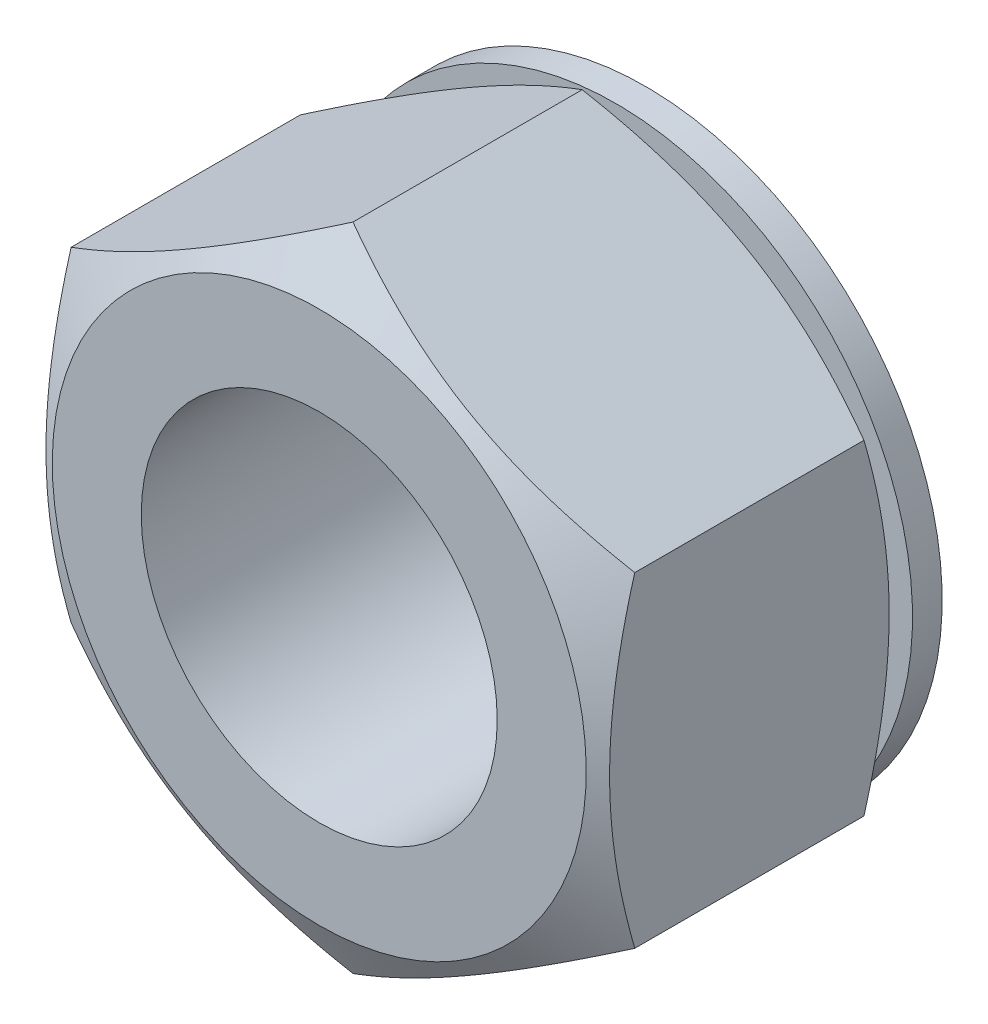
ISO-10303-21;
HEADER;
FILE_DESCRIPTION(('STEP AP214'),'2;1');
FILE_NAME('part.step','',(''),(''),'','','');
FILE_SCHEMA(('AUTOMOTIVE_DESIGN { 1 0 10303 214 1 1 1 1 }'));
ENDSEC;
DATA;
#1=APPLICATION_CONTEXT('core data for automotive mechanical design processes');
#2=APPLICATION_PROTOCOL_DEFINITION('international standard','automotive_design',2000,#1);
#3=PRODUCT_CONTEXT('',#1,'mechanical');
#4=PRODUCT('Part','Part','',(#3));
#5=PRODUCT_RELATED_PRODUCT_CATEGORY('part','',(#4));
#6=PRODUCT_DEFINITION_FORMATION('','',#4);
#7=PRODUCT_DEFINITION_CONTEXT('part definition',#1,'design');
#8=PRODUCT_DEFINITION('design','',#6,#7);
#9=PRODUCT_DEFINITION_SHAPE('','',#8);
#10=(LENGTH_UNIT() NAMED_UNIT(*) SI_UNIT(.MILLI.,.METRE.));
#11=(NAMED_UNIT(*) PLANE_ANGLE_UNIT() SI_UNIT($,.RADIAN.));
#12=(NAMED_UNIT(*) SI_UNIT($,.STERADIAN.) SOLID_ANGLE_UNIT());
#13=UNCERTAINTY_MEASURE_WITH_UNIT(LENGTH_MEASURE(1.E-05),#10,'distance_accuracy_value','');
#14=(GEOMETRIC_REPRESENTATION_CONTEXT(3) GLOBAL_UNCERTAINTY_ASSIGNED_CONTEXT((#13)) GLOBAL_UNIT_ASSIGNED_CONTEXT((#10,
#11,#12)) REPRESENTATION_CONTEXT('',''));
#15=CARTESIAN_POINT('',(0.,0.,0.));
#16=DIRECTION('',(0.,0.,1.));
#17=DIRECTION('',(1.,0.,0.));
#18=AXIS2_PLACEMENT_3D('',#15,#16,#17);
#19=CARTESIAN_POINT('',(9.5,-5.48482755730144,1.));
#20=DIRECTION('',(1.,0.,0.));
#21=DIRECTION('',(0.,0.,-1.));
#22=AXIS2_PLACEMENT_3D('',#19,#20,#21);
#23=PLANE('',#22);
#24=DIRECTION('',(0.,0.,1.));
#25=VECTOR('',#24,1.);
#26=CARTESIAN_POINT('',(9.5,-5.48482755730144,1.));
#27=LINE('',#26,#25);
#28=CARTESIAN_POINT('',(9.5,-5.48482755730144,2.13718091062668));
#29=VERTEX_POINT('',#28);
#30=CARTESIAN_POINT('',(9.5,-5.48482755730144,9.86281908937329));
#31=VERTEX_POINT('',#30);
#32=EDGE_CURVE('E23',#29,#31,#27,.T.);
#33=ORIENTED_EDGE('',*,*,#32,.F.);
#34=CARTESIAN_POINT('',(9.5,-14.6203705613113,5.87038017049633));
#35=CARTESIAN_POINT('',(9.5,-14.4133760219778,5.77017103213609));
#36=CARTESIAN_POINT('',(9.5,-14.2061355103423,5.67047021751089));
#37=CARTESIAN_POINT('',(9.5,-13.7911111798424,5.47220059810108));
#38=CARTESIAN_POINT('',(9.5,-13.5833273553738,5.37363180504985));
#39=CARTESIAN_POINT('',(9.5,-12.9590269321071,5.07976977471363));
#40=CARTESIAN_POINT('',(9.5,-12.5416243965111,4.88635147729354));
#41=CARTESIAN_POINT('',(9.5,-11.7016619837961,4.50464044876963));
#42=CARTESIAN_POINT('',(9.5,-11.279086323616,4.31638236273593));
#43=CARTESIAN_POINT('',(9.5,-10.4305349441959,3.94771952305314));
#44=CARTESIAN_POINT('',(9.5,-10.004559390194,3.76731439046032));
#45=CARTESIAN_POINT('',(9.5,-9.13523598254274,3.41099063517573));
#46=CARTESIAN_POINT('',(9.5,-8.69175917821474,3.2353848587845));
#47=CARTESIAN_POINT('',(9.5,-7.79957695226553,2.89773819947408));
#48=CARTESIAN_POINT('',(9.5,-7.3508709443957,2.73569885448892));
#49=CARTESIAN_POINT('',(9.5,-6.44838780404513,2.42952239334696));
#50=CARTESIAN_POINT('',(9.5,-5.99462344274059,2.28534804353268));
#51=CARTESIAN_POINT('',(9.5,-5.08060402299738,2.01959961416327));
#52=CARTESIAN_POINT('',(9.5,-4.62035109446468,1.89801829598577));
#53=CARTESIAN_POINT('',(9.5,-3.69554066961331,1.68401115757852));
#54=CARTESIAN_POINT('',(9.5,-3.23101965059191,1.59143200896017));
#55=CARTESIAN_POINT('',(9.5,-2.53009968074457,1.47838032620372));
#56=CARTESIAN_POINT('',(9.5,-2.29575188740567,1.44499770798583));
#57=CARTESIAN_POINT('',(9.5,-1.82593015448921,1.38749533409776));
#58=CARTESIAN_POINT('',(9.5,-1.59045632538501,1.36337468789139));
#59=CARTESIAN_POINT('',(9.5,-1.12172453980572,1.32517356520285));
#60=CARTESIAN_POINT('',(9.5,-0.888476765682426,1.31096861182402));
#61=CARTESIAN_POINT('',(9.5,-0.421589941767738,1.29242683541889));
#62=CARTESIAN_POINT('',(9.5,-0.187950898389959,1.2880898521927));
#63=CARTESIAN_POINT('',(9.5,0.279302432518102,1.289387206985));
#64=CARTESIAN_POINT('',(9.5,0.512916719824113,1.29502162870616));
#65=CARTESIAN_POINT('',(9.5,0.979703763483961,1.31612625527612));
#66=CARTESIAN_POINT('',(9.5,1.21287649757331,1.33159694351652));
#67=CARTESIAN_POINT('',(9.5,1.7767093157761,1.38057544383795));
#68=CARTESIAN_POINT('',(9.5,2.10695454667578,1.41894135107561));
#69=CARTESIAN_POINT('',(9.5,2.76492123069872,1.51328725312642));
#70=CARTESIAN_POINT('',(9.5,3.09264232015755,1.56926973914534));
#71=CARTESIAN_POINT('',(9.5,3.74527313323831,1.69685709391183));
#72=CARTESIAN_POINT('',(9.5,4.07018038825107,1.76847447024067));
#73=CARTESIAN_POINT('',(9.5,4.71670052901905,1.9251529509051));
#74=CARTESIAN_POINT('',(9.5,5.03831347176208,2.01021382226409));
#75=CARTESIAN_POINT('',(9.5,5.68526467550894,2.19371212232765));
#76=CARTESIAN_POINT('',(9.5,6.01053116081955,2.29240087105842));
#77=CARTESIAN_POINT('',(9.5,6.65785880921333,2.49973087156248));
#78=CARTESIAN_POINT('',(9.5,6.97991995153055,2.60837218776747));
#79=CARTESIAN_POINT('',(9.5,7.6210004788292,2.83390376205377));
#80=CARTESIAN_POINT('',(9.5,7.94002088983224,2.95079111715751));
#81=CARTESIAN_POINT('',(9.5,8.5754344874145,3.19146361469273));
#82=CARTESIAN_POINT('',(9.5,8.89182770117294,3.31524868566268));
#83=CARTESIAN_POINT('',(9.5,9.62350368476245,3.60923639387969));
#84=CARTESIAN_POINT('',(9.5,10.0379237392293,3.78158261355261));
#85=CARTESIAN_POINT('',(9.5,10.8633742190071,4.13423174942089));
#86=CARTESIAN_POINT('',(9.5,11.2744044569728,4.31453510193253));
#87=CARTESIAN_POINT('',(9.5,12.0936880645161,4.68154456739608));
#88=CARTESIAN_POINT('',(9.5,12.5019408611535,4.86825195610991));
#89=CARTESIAN_POINT('',(9.5,13.3160389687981,5.2468118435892));
#90=CARTESIAN_POINT('',(9.5,13.7218843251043,5.43866424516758));
#91=CARTESIAN_POINT('',(9.5,14.5319664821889,5.82676971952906));
#92=CARTESIAN_POINT('',(9.5,14.9362012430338,6.0230270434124));
#93=CARTESIAN_POINT('',(9.5,15.7429612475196,6.41902284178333));
#94=CARTESIAN_POINT('',(9.5,16.145486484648,6.61876132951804));
#95=CARTESIAN_POINT('',(9.5,17.3508043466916,7.22224773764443));
#96=CARTESIAN_POINT('',(9.5,18.1514351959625,7.63031299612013));
#97=CARTESIAN_POINT('',(9.5,19.6840581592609,8.4213562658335));
#98=CARTESIAN_POINT('',(9.5,20.4163776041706,8.80370283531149));
#99=CARTESIAN_POINT('',(9.5,21.8782922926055,9.57362126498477));
#100=CARTESIAN_POINT('',(9.5,22.607887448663,9.96119329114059));
#101=CARTESIAN_POINT('',(9.5,24.0632507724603,10.7394285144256));
#102=CARTESIAN_POINT('',(9.5,24.7890238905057,11.1300824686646));
#103=CARTESIAN_POINT('',(9.5,26.2388196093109,11.914537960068));
#104=CARTESIAN_POINT('',(9.5,26.9628422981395,12.3083393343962));
#105=CARTESIAN_POINT('',(9.5,27.686216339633,12.7033206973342));
#106=B_SPLINE_CURVE_WITH_KNOTS('',3,(#34,#35,#36,#37,#38,#39,#40,#41,#42,#43,#44,#45,#46,#47,
#48,#49,#50,#51,#52,#53,#54,#55,#56,#57,#58,#59,#60,#61,#62,#63,#64,#65,#66,#67,#68,#69,#70,#71,
#72,#73,#74,#75,#76,#77,#78,#79,#80,#81,#82,#83,#84,#85,#86,#87,#88,#89,#90,#91,#92,#93,#94,#95,
#96,#97,#98,#99,#100,#101,#102,#103,#104,#105),.UNSPECIFIED.,.F.,.F.,(4,2,2,2,2,2,2,2,2,2,2,2,2,
2,2,2,2,2,2,2,2,2,2,2,2,2,2,2,2,2,2,2,2,2,2,4),(0.,0.689924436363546,1.37985601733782,
2.7599293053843,4.14770758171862,5.53541881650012,6.9661840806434,8.39711132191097,
9.82500423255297,11.2524388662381,12.6721943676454,13.38218061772,14.0920985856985,
14.7929360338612,15.4937621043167,16.1945940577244,16.8954604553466,17.8923053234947,
18.8892912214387,19.8870776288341,20.8848467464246,21.9043812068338,22.9239222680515,
23.9431061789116,24.9622795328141,26.3086543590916,27.6551031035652,29.0018216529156,
30.348514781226,31.6965687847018,33.0446279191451,35.7404261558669,38.2187752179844,
40.6972031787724,43.1698886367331,45.6424469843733),.UNSPECIFIED.);
#107=CARTESIAN_POINT('',(9.5,5.48482755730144,2.13718091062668));
#108=VERTEX_POINT('',#107);
#109=EDGE_CURVE('E70',#29,#108,#106,.T.);
#110=ORIENTED_EDGE('',*,*,#109,.T.);
#111=DIRECTION('',(0.,0.,1.));
#112=VECTOR('',#111,1.);
#113=CARTESIAN_POINT('',(9.5,5.48482755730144,1.));
#114=LINE('',#113,#112);
#115=CARTESIAN_POINT('',(9.5,5.48482755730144,9.8628190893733));
#116=VERTEX_POINT('',#115);
#117=EDGE_CURVE('E38',#108,#116,#114,.T.);
#118=ORIENTED_EDGE('',*,*,#117,.T.);
#119=CARTESIAN_POINT('',(9.5,-14.6687006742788,6.1062105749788));
#120=CARTESIAN_POINT('',(9.5,-14.4615084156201,6.20661354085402));
#121=CARTESIAN_POINT('',(9.5,-14.2540712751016,6.30651093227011));
#122=CARTESIAN_POINT('',(9.5,-13.8386561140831,6.5051799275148));
#123=CARTESIAN_POINT('',(9.5,-13.63067808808,6.60395151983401));
#124=CARTESIAN_POINT('',(9.5,-13.0057997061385,6.89843210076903));
#125=CARTESIAN_POINT('',(9.5,-12.5880173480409,7.09227661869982));
#126=CARTESIAN_POINT('',(9.5,-11.7473306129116,7.47486662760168));
#127=CARTESIAN_POINT('',(9.5,-11.3244106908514,7.66357804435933));
#128=CARTESIAN_POINT('',(9.5,-10.4751851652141,8.03319466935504));
#129=CARTESIAN_POINT('',(9.5,-10.0488797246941,8.21410025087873));
#130=CARTESIAN_POINT('',(9.5,-9.17870639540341,8.57158234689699));
#131=CARTESIAN_POINT('',(9.5,-8.73470813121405,8.74784326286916));
#132=CARTESIAN_POINT('',(9.5,-7.84149462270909,9.08686908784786));
#133=CARTESIAN_POINT('',(9.5,-7.39227879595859,9.24963247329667));
#134=CARTESIAN_POINT('',(9.5,-6.48877170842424,9.55734250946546));
#135=CARTESIAN_POINT('',(9.5,-6.03449305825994,9.70232578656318));
#136=CARTESIAN_POINT('',(9.5,-5.11943656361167,9.96978322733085));
#137=CARTESIAN_POINT('',(9.5,-4.65866083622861,10.0922645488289));
#138=CARTESIAN_POINT('',(9.5,-3.73280971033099,10.3081434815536));
#139=CARTESIAN_POINT('',(9.5,-3.26777143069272,10.4016959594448));
#140=CARTESIAN_POINT('',(9.5,-2.56603115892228,10.5162443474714));
#141=CARTESIAN_POINT('',(9.5,-2.33140289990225,10.5501319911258));
#142=CARTESIAN_POINT('',(9.5,-1.86100211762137,10.6086477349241));
#143=CARTESIAN_POINT('',(9.5,-1.62522970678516,10.6332767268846));
#144=CARTESIAN_POINT('',(9.5,-1.15590855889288,10.6724788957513));
#145=CARTESIAN_POINT('',(9.5,-0.922370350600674,10.6871776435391));
#146=CARTESIAN_POINT('',(9.5,-0.454881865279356,10.7066905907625));
#147=CARTESIAN_POINT('',(9.5,-0.220931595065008,10.7115049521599));
#148=CARTESIAN_POINT('',(9.5,0.246963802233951,10.7111344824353));
#149=CARTESIAN_POINT('',(9.5,0.480908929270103,10.7059495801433));
#150=CARTESIAN_POINT('',(9.5,0.948374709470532,10.685706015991));
#151=CARTESIAN_POINT('',(9.5,1.1818953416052,10.6706468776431));
#152=CARTESIAN_POINT('',(9.5,1.74506682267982,10.6227394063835));
#153=CARTESIAN_POINT('',(9.5,2.07431695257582,10.5850979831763));
#154=CARTESIAN_POINT('',(9.5,2.73033314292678,10.4922512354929));
#155=CARTESIAN_POINT('',(9.5,3.05709885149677,10.4370434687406));
#156=CARTESIAN_POINT('',(9.5,3.70784821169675,10.3110280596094));
#157=CARTESIAN_POINT('',(9.5,4.03182945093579,10.240208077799));
#158=CARTESIAN_POINT('',(9.5,4.67652238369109,10.0851254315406));
#159=CARTESIAN_POINT('',(9.5,4.99723413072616,10.0008629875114));
#160=CARTESIAN_POINT('',(9.5,5.64242354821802,9.81895500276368));
#161=CARTESIAN_POINT('',(9.5,5.96682934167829,9.72105628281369));
#162=CARTESIAN_POINT('',(9.5,6.61244437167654,9.51528505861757));
#163=CARTESIAN_POINT('',(9.5,6.93365358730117,9.40741248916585));
#164=CARTESIAN_POINT('',(9.5,7.57303689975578,9.18339402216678));
#165=CARTESIAN_POINT('',(9.5,7.89121199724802,9.06725096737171));
#166=CARTESIAN_POINT('',(9.5,8.52493489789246,8.82804408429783));
#167=CARTESIAN_POINT('',(9.5,8.84048273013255,8.70498033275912));
#168=CARTESIAN_POINT('',(9.5,9.57839301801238,8.40935841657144));
#169=CARTESIAN_POINT('',(9.5,9.99981165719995,8.23444805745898));
#170=CARTESIAN_POINT('',(9.5,10.8391313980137,7.87635862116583));
#171=CARTESIAN_POINT('',(9.5,11.2570322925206,7.69317906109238));
#172=CARTESIAN_POINT('',(9.5,12.0899638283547,7.32018999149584));
#173=CARTESIAN_POINT('',(9.5,12.5049938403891,7.13037908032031));
#174=CARTESIAN_POINT('',(9.5,13.3325690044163,6.74544973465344));
#175=CARTESIAN_POINT('',(9.5,13.7451142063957,6.55033140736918));
#176=CARTESIAN_POINT('',(9.5,14.5685623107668,6.15556291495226));
#177=CARTESIAN_POINT('',(9.5,14.9794630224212,5.9559081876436));
#178=CARTESIAN_POINT('',(9.5,15.7995097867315,5.55302873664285));
#179=CARTESIAN_POINT('',(9.5,16.2086558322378,5.34980399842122));
#180=CARTESIAN_POINT('',(9.5,17.4337773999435,4.73576454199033));
#181=CARTESIAN_POINT('',(9.5,18.2475397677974,4.32053460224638));
#182=CARTESIAN_POINT('',(9.5,19.8038422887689,3.51634543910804));
#183=CARTESIAN_POINT('',(9.5,20.5467231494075,3.12804266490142));
#184=CARTESIAN_POINT('',(9.5,22.0297276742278,2.34615077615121));
#185=CARTESIAN_POINT('',(9.5,22.7698512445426,1.952561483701));
#186=CARTESIAN_POINT('',(9.5,24.2461609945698,1.16230376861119));
#187=CARTESIAN_POINT('',(9.5,24.9823523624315,0.765645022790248));
#188=CARTESIAN_POINT('',(9.5,26.4529685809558,-0.0308418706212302));
#189=CARTESIAN_POINT('',(9.5,27.187393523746,-0.430669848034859));
#190=CARTESIAN_POINT('',(9.5,27.9211664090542,-0.831682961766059));
#191=B_SPLINE_CURVE_WITH_KNOTS('',3,(#119,#120,#121,#122,#123,#124,#125,#126,#127,#128,#129,
#130,#131,#132,#133,#134,#135,#136,#137,#138,#139,#140,#141,#142,#143,#144,#145,#146,#147,#148,
#149,#150,#151,#152,#153,#154,#155,#156,#157,#158,#159,#160,#161,#162,#163,#164,#165,#166,#167,
#168,#169,#170,#171,#172,#173,#174,#175,#176,#177,#178,#179,#180,#181,#182,#183,#184,#185,#186,
#187,#188,#189,#190),.UNSPECIFIED.,.F.,.F.,(4,2,2,2,2,2,2,2,2,2,2,2,2,2,2,2,2,2,2,2,2,2,2,2,2,2,
2,2,2,2,2,2,2,2,2,4),(0.,0.690711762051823,1.38143057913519,2.76307600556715,4.15235213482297,
5.54156175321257,6.97450756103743,8.40761489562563,9.83771864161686,11.2673666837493,
12.6892232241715,13.4002577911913,14.1112238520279,14.8130222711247,15.5148091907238,
16.2166011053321,16.9184268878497,17.9120601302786,18.9058315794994,19.9003913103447,
20.8949347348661,21.911310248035,22.9276924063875,23.9437268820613,24.9597500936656,
26.3284573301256,27.6972445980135,29.0663229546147,30.4353736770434,31.8058681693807,
33.1763682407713,35.9170238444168,38.4317295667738,40.9465201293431,43.455265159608,
45.9638763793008),.UNSPECIFIED.);
#192=EDGE_CURVE('E90',#31,#116,#191,.T.);
#193=ORIENTED_EDGE('',*,*,#192,.F.);
#194=EDGE_LOOP('',(#33,#110,#118,#193));
#195=FACE_BOUND('',#194,.T.);
#196=ADVANCED_FACE('F14',(#195),#23,.T.);
#197=CARTESIAN_POINT('',(9.5,-5.48482755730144,1.));
#198=DIRECTION('',(-0.5,0.86602540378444,0.));
#199=DIRECTION('',(0.86602540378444,0.5,0.));
#200=AXIS2_PLACEMENT_3D('',#197,#198,#199);
#201=PLANE('',#200);
#202=CARTESIAN_POINT('',(9.5002,-5.4847120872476,2.13724757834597));
#203=CARTESIAN_POINT('',(9.2913692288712,-5.60528058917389,2.06764857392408));
#204=CARTESIAN_POINT('',(9.08175982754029,-5.72629863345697,2.00120844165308));
#205=CARTESIAN_POINT('',(8.66086011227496,-5.96930519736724,1.87552241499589));
#206=CARTESIAN_POINT('',(8.44956926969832,-6.09129402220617,1.81627888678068));
#207=CARTESIAN_POINT('',(7.81229220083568,-6.45922610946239,1.65048970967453));
#208=CARTESIAN_POINT('',(7.38379023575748,-6.70662183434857,1.5561895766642));
#209=CARTESIAN_POINT('',(6.74255666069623,-7.07683821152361,1.44561383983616));
#210=CARTESIAN_POINT('',(6.53174078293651,-7.19855281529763,1.41411496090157));
#211=CARTESIAN_POINT('',(6.10913296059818,-7.4425455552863,1.36129333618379));
#212=CARTESIAN_POINT('',(5.89734099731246,-7.56482370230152,1.33997078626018));
#213=CARTESIAN_POINT('',(5.47340378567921,-7.80958396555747,1.30804815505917));
#214=CARTESIAN_POINT('',(5.26125925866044,-7.93206566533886,1.29743533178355));
#215=CARTESIAN_POINT('',(4.83677424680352,-8.17714220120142,1.28715766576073));
#216=CARTESIAN_POINT('',(4.62443376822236,-8.2997370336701,1.28749248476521));
#217=CARTESIAN_POINT('',(4.22745800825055,-8.52893109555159,1.29834850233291));
#218=CARTESIAN_POINT('',(4.04279470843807,-8.63554650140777,1.30754540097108));
#219=CARTESIAN_POINT('',(3.67389999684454,-8.84852796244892,1.33404053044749));
#220=CARTESIAN_POINT('',(3.48966861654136,-8.95489399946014,1.35133933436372));
#221=CARTESIAN_POINT('',(2.937688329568,-9.27357996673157,1.41497961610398));
#222=CARTESIAN_POINT('',(2.57091646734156,-9.48533580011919,1.47305703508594));
#223=CARTESIAN_POINT('',(1.83348217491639,-9.91109368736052,1.61825114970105));
#224=CARTESIAN_POINT('',(1.46291385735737,-10.1250414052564,1.70598330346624));
#225=CARTESIAN_POINT('',(0.727303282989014,-10.5497463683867,1.90509887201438));
#226=CARTESIAN_POINT('',(0.36225160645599,-10.7605090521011,2.01643552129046));
#227=CARTESIAN_POINT('',(-0.000200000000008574,-10.9697705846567,2.13724757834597));
#228=B_SPLINE_CURVE_WITH_KNOTS('',3,(#202,#203,#204,#205,#206,#207,#208,#209,#210,#211,#212,
#213,#214,#215,#216,#217,#218,#219,#220,#221,#222,#223,#224,#225,#226,#227),.UNSPECIFIED.,.F.,
.F.,(4,2,2,2,2,2,2,2,2,2,2,2,4),(0.,0.752880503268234,1.50600787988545,3.0154687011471,
3.75167336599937,4.48789219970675,5.22323407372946,5.95855322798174,6.5986808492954,
7.23885375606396,8.52010929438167,9.82978009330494,11.1368800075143),.UNSPECIFIED.);
#229=CARTESIAN_POINT('',(0.,-10.9696551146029,2.13718091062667));
#230=VERTEX_POINT('',#229);
#231=EDGE_CURVE('E78',#29,#230,#228,.T.);
#232=ORIENTED_EDGE('',*,*,#231,.F.);
#233=ORIENTED_EDGE('',*,*,#32,.T.);
#234=CARTESIAN_POINT('',(9.5002,-5.4847120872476,9.86275242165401));
#235=CARTESIAN_POINT('',(9.2913692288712,-5.60528058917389,9.93235142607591));
#236=CARTESIAN_POINT('',(9.08175982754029,-5.72629863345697,9.99879155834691));
#237=CARTESIAN_POINT('',(8.66086011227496,-5.96930519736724,10.1244775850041));
#238=CARTESIAN_POINT('',(8.44956926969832,-6.09129402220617,10.1837211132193));
#239=CARTESIAN_POINT('',(7.81229220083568,-6.45922610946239,10.3495102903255));
#240=CARTESIAN_POINT('',(7.38379023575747,-6.70662183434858,10.4438104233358));
#241=CARTESIAN_POINT('',(6.74255666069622,-7.07683821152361,10.5543861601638));
#242=CARTESIAN_POINT('',(6.53174078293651,-7.19855281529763,10.5858850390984));
#243=CARTESIAN_POINT('',(6.10913296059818,-7.44254555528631,10.6387066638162));
#244=CARTESIAN_POINT('',(5.89734099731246,-7.56482370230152,10.6600292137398));
#245=CARTESIAN_POINT('',(5.4734037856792,-7.80958396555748,10.6919518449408));
#246=CARTESIAN_POINT('',(5.26125925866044,-7.93206566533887,10.7025646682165));
#247=CARTESIAN_POINT('',(4.83677424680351,-8.17714220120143,10.7128423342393));
#248=CARTESIAN_POINT('',(4.62443376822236,-8.29973703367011,10.7125075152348));
#249=CARTESIAN_POINT('',(4.22745800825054,-8.5289310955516,10.7016514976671));
#250=CARTESIAN_POINT('',(4.04279470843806,-8.63554650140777,10.6924545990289));
#251=CARTESIAN_POINT('',(3.67389999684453,-8.84852796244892,10.6659594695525));
#252=CARTESIAN_POINT('',(3.48966861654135,-8.95489399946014,10.6486606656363));
#253=CARTESIAN_POINT('',(2.93768832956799,-9.27357996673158,10.585020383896));
#254=CARTESIAN_POINT('',(2.57091646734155,-9.48533580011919,10.5269429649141));
#255=CARTESIAN_POINT('',(1.83348217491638,-9.91109368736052,10.3817488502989));
#256=CARTESIAN_POINT('',(1.46291385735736,-10.1250414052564,10.2940166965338));
#257=CARTESIAN_POINT('',(0.727303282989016,-10.5497463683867,10.0949011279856));
#258=CARTESIAN_POINT('',(0.362251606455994,-10.7605090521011,9.98356447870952));
#259=CARTESIAN_POINT('',(-0.00020000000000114,-10.9697705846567,9.86275242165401));
#260=B_SPLINE_CURVE_WITH_KNOTS('',3,(#234,#235,#236,#237,#238,#239,#240,#241,#242,#243,#244,
#245,#246,#247,#248,#249,#250,#251,#252,#253,#254,#255,#256,#257,#258,#259),.UNSPECIFIED.,.F.,
.F.,(4,2,2,2,2,2,2,2,2,2,2,2,4),(0.,0.752880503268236,1.50600787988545,3.0154687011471,
3.75167336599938,4.48789219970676,5.22323407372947,5.95855322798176,6.59868084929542,
7.23885375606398,8.52010929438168,9.82978009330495,11.1368800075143),.UNSPECIFIED.);
#261=CARTESIAN_POINT('',(0.,-10.9696551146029,9.8628190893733));
#262=VERTEX_POINT('',#261);
#263=EDGE_CURVE('E102',#31,#262,#260,.T.);
#264=ORIENTED_EDGE('',*,*,#263,.T.);
#265=DIRECTION('',(0.,0.,1.));
#266=VECTOR('',#265,1.);
#267=CARTESIAN_POINT('',(0.,-10.9696551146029,1.));
#268=LINE('',#267,#266);
#269=EDGE_CURVE('E97',#230,#262,#268,.T.);
#270=ORIENTED_EDGE('',*,*,#269,.F.);
#271=EDGE_LOOP('',(#232,#233,#264,#270));
#272=FACE_BOUND('',#271,.T.);
#273=ADVANCED_FACE('F16',(#272),#201,.F.);
#274=CARTESIAN_POINT('',(-9.5,-5.48482755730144,1.));
#275=DIRECTION('',(-0.5,-0.86602540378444,0.));
#276=DIRECTION('',(-0.86602540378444,0.5,0.));
#277=AXIS2_PLACEMENT_3D('',#274,#275,#276);
#278=PLANE('',#277);
#279=DIRECTION('',(0.,0.,1.));
#280=VECTOR('',#279,1.);
#281=CARTESIAN_POINT('',(-9.5,-5.48482755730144,1.));
#282=LINE('',#281,#280);
#283=CARTESIAN_POINT('',(-9.5,-5.48482755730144,2.13718091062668));
#284=VERTEX_POINT('',#283);
#285=CARTESIAN_POINT('',(-9.5,-5.48482755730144,9.86281908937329));
#286=VERTEX_POINT('',#285);
#287=EDGE_CURVE('E95',#284,#286,#282,.T.);
#288=ORIENTED_EDGE('',*,*,#287,.F.);
#289=CARTESIAN_POINT('',(-9.5002,-5.4847120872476,2.13724757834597));
#290=CARTESIAN_POINT('',(-9.2913692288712,-5.60528058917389,2.06764857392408));
#291=CARTESIAN_POINT('',(-9.08175982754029,-5.72629863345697,2.00120844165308));
#292=CARTESIAN_POINT('',(-8.66086011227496,-5.96930519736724,1.87552241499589));
#293=CARTESIAN_POINT('',(-8.44956926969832,-6.09129402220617,1.81627888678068));
#294=CARTESIAN_POINT('',(-7.81229220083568,-6.45922610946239,1.65048970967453));
#295=CARTESIAN_POINT('',(-7.38379023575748,-6.70662183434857,1.5561895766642));
#296=CARTESIAN_POINT('',(-6.74255666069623,-7.07683821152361,1.44561383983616));
#297=CARTESIAN_POINT('',(-6.53174078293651,-7.19855281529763,1.41411496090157));
#298=CARTESIAN_POINT('',(-6.10913296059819,-7.4425455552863,1.36129333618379));
#299=CARTESIAN_POINT('',(-5.89734099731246,-7.56482370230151,1.33997078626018));
#300=CARTESIAN_POINT('',(-5.47340378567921,-7.80958396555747,1.30804815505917));
#301=CARTESIAN_POINT('',(-5.26125925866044,-7.93206566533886,1.29743533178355));
#302=CARTESIAN_POINT('',(-4.83677424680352,-8.17714220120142,1.28715766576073));
#303=CARTESIAN_POINT('',(-4.62443376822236,-8.2997370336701,1.28749248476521));
#304=CARTESIAN_POINT('',(-4.22745800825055,-8.52893109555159,1.29834850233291));
#305=CARTESIAN_POINT('',(-4.04279470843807,-8.63554650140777,1.30754540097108));
#306=CARTESIAN_POINT('',(-3.67389999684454,-8.84852796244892,1.33404053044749));
#307=CARTESIAN_POINT('',(-3.48966861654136,-8.95489399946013,1.35133933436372));
#308=CARTESIAN_POINT('',(-2.937688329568,-9.27357996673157,1.41497961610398));
#309=CARTESIAN_POINT('',(-2.57091646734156,-9.48533580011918,1.47305703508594));
#310=CARTESIAN_POINT('',(-1.83348217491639,-9.91109368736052,1.61825114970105));
#311=CARTESIAN_POINT('',(-1.46291385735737,-10.1250414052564,1.70598330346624));
#312=CARTESIAN_POINT('',(-0.727303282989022,-10.5497463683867,1.90509887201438));
#313=CARTESIAN_POINT('',(-0.362251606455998,-10.7605090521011,2.01643552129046));
#314=CARTESIAN_POINT('',(0.000200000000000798,-10.9697705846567,2.13724757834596));
#315=B_SPLINE_CURVE_WITH_KNOTS('',3,(#289,#290,#291,#292,#293,#294,#295,#296,#297,#298,#299,
#300,#301,#302,#303,#304,#305,#306,#307,#308,#309,#310,#311,#312,#313,#314),.UNSPECIFIED.,.F.,
.F.,(4,2,2,2,2,2,2,2,2,2,2,2,4),(0.,0.752880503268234,1.50600787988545,3.01546870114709,
3.75167336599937,4.48789219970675,5.22323407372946,5.95855322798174,6.5986808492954,
7.23885375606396,8.52010929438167,9.82978009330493,11.1368800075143),.UNSPECIFIED.);
#316=EDGE_CURVE('E169',#284,#230,#315,.T.);
#317=ORIENTED_EDGE('',*,*,#316,.T.);
#318=ORIENTED_EDGE('',*,*,#269,.T.);
#319=CARTESIAN_POINT('',(-9.5002,-5.4847120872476,9.86275242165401));
#320=CARTESIAN_POINT('',(-9.2913692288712,-5.60528058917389,9.93235142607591));
#321=CARTESIAN_POINT('',(-9.08175982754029,-5.72629863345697,9.99879155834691));
#322=CARTESIAN_POINT('',(-8.66086011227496,-5.96930519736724,10.1244775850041));
#323=CARTESIAN_POINT('',(-8.44956926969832,-6.09129402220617,10.1837211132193));
#324=CARTESIAN_POINT('',(-7.81229220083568,-6.45922610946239,10.3495102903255));
#325=CARTESIAN_POINT('',(-7.38379023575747,-6.70662183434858,10.4438104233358));
#326=CARTESIAN_POINT('',(-6.74255666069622,-7.07683821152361,10.5543861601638));
#327=CARTESIAN_POINT('',(-6.53174078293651,-7.19855281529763,10.5858850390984));
#328=CARTESIAN_POINT('',(-6.10913296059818,-7.44254555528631,10.6387066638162));
#329=CARTESIAN_POINT('',(-5.89734099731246,-7.56482370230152,10.6600292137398));
#330=CARTESIAN_POINT('',(-5.4734037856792,-7.80958396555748,10.6919518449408));
#331=CARTESIAN_POINT('',(-5.26125925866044,-7.93206566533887,10.7025646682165));
#332=CARTESIAN_POINT('',(-4.83677424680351,-8.17714220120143,10.7128423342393));
#333=CARTESIAN_POINT('',(-4.62443376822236,-8.29973703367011,10.7125075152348));
#334=CARTESIAN_POINT('',(-4.22745800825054,-8.5289310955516,10.7016514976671));
#335=CARTESIAN_POINT('',(-4.04279470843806,-8.63554650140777,10.6924545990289));
#336=CARTESIAN_POINT('',(-3.67389999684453,-8.84852796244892,10.6659594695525));
#337=CARTESIAN_POINT('',(-3.48966861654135,-8.95489399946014,10.6486606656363));
#338=CARTESIAN_POINT('',(-2.93768832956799,-9.27357996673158,10.585020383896));
#339=CARTESIAN_POINT('',(-2.57091646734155,-9.48533580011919,10.5269429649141));
#340=CARTESIAN_POINT('',(-1.83348217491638,-9.91109368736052,10.3817488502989));
#341=CARTESIAN_POINT('',(-1.46291385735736,-10.1250414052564,10.2940166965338));
#342=CARTESIAN_POINT('',(-0.727303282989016,-10.5497463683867,10.0949011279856));
#343=CARTESIAN_POINT('',(-0.362251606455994,-10.7605090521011,9.98356447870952));
#344=CARTESIAN_POINT('',(0.00020000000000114,-10.9697705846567,9.86275242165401));
#345=B_SPLINE_CURVE_WITH_KNOTS('',3,(#319,#320,#321,#322,#323,#324,#325,#326,#327,#328,#329,
#330,#331,#332,#333,#334,#335,#336,#337,#338,#339,#340,#341,#342,#343,#344),.UNSPECIFIED.,.F.,
.F.,(4,2,2,2,2,2,2,2,2,2,2,2,4),(0.,0.752880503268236,1.50600787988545,3.0154687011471,
3.75167336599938,4.48789219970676,5.22323407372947,5.95855322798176,6.59868084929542,
7.23885375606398,8.52010929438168,9.82978009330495,11.1368800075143),.UNSPECIFIED.);
#346=EDGE_CURVE('E109',#286,#262,#345,.T.);
#347=ORIENTED_EDGE('',*,*,#346,.F.);
#348=EDGE_LOOP('',(#288,#317,#318,#347));
#349=FACE_BOUND('',#348,.T.);
#350=ADVANCED_FACE('F161',(#349),#278,.T.);
#351=CARTESIAN_POINT('',(-9.5,-5.48482755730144,1.));
#352=DIRECTION('',(1.,0.,0.));
#353=DIRECTION('',(0.,0.,-1.));
#354=AXIS2_PLACEMENT_3D('',#351,#352,#353);
#355=PLANE('',#354);
#356=CARTESIAN_POINT('',(-9.5,-14.6203705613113,5.87038017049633));
#357=CARTESIAN_POINT('',(-9.5,-14.4133760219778,5.77017103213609));
#358=CARTESIAN_POINT('',(-9.5,-14.2061355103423,5.67047021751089));
#359=CARTESIAN_POINT('',(-9.5,-13.7911111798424,5.47220059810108));
#360=CARTESIAN_POINT('',(-9.5,-13.5833273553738,5.37363180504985));
#361=CARTESIAN_POINT('',(-9.5,-12.9590269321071,5.07976977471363));
#362=CARTESIAN_POINT('',(-9.5,-12.5416243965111,4.88635147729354));
#363=CARTESIAN_POINT('',(-9.5,-11.7016619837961,4.50464044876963));
#364=CARTESIAN_POINT('',(-9.5,-11.279086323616,4.31638236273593));
#365=CARTESIAN_POINT('',(-9.5,-10.4305349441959,3.94771952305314));
#366=CARTESIAN_POINT('',(-9.5,-10.004559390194,3.76731439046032));
#367=CARTESIAN_POINT('',(-9.5,-9.13523598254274,3.41099063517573));
#368=CARTESIAN_POINT('',(-9.5,-8.69175917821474,3.2353848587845));
#369=CARTESIAN_POINT('',(-9.5,-7.79957695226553,2.89773819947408));
#370=CARTESIAN_POINT('',(-9.5,-7.3508709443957,2.73569885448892));
#371=CARTESIAN_POINT('',(-9.5,-6.44838780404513,2.42952239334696));
#372=CARTESIAN_POINT('',(-9.5,-5.99462344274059,2.28534804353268));
#373=CARTESIAN_POINT('',(-9.5,-5.08060402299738,2.01959961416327));
#374=CARTESIAN_POINT('',(-9.5,-4.62035109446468,1.89801829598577));
#375=CARTESIAN_POINT('',(-9.5,-3.69554066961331,1.68401115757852));
#376=CARTESIAN_POINT('',(-9.5,-3.23101965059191,1.59143200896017));
#377=CARTESIAN_POINT('',(-9.5,-2.53009968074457,1.47838032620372));
#378=CARTESIAN_POINT('',(-9.5,-2.29575188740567,1.44499770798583));
#379=CARTESIAN_POINT('',(-9.5,-1.82593015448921,1.38749533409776));
#380=CARTESIAN_POINT('',(-9.5,-1.59045632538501,1.36337468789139));
#381=CARTESIAN_POINT('',(-9.5,-1.12172453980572,1.32517356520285));
#382=CARTESIAN_POINT('',(-9.5,-0.888476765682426,1.31096861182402));
#383=CARTESIAN_POINT('',(-9.5,-0.421589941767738,1.29242683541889));
#384=CARTESIAN_POINT('',(-9.5,-0.187950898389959,1.2880898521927));
#385=CARTESIAN_POINT('',(-9.5,0.279302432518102,1.289387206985));
#386=CARTESIAN_POINT('',(-9.5,0.512916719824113,1.29502162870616));
#387=CARTESIAN_POINT('',(-9.5,0.979703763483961,1.31612625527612));
#388=CARTESIAN_POINT('',(-9.5,1.21287649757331,1.33159694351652));
#389=CARTESIAN_POINT('',(-9.5,1.7767093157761,1.38057544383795));
#390=CARTESIAN_POINT('',(-9.5,2.10695454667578,1.41894135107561));
#391=CARTESIAN_POINT('',(-9.5,2.76492123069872,1.51328725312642));
#392=CARTESIAN_POINT('',(-9.5,3.09264232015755,1.56926973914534));
#393=CARTESIAN_POINT('',(-9.5,3.74527313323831,1.69685709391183));
#394=CARTESIAN_POINT('',(-9.5,4.07018038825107,1.76847447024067));
#395=CARTESIAN_POINT('',(-9.5,4.71670052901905,1.9251529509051));
#396=CARTESIAN_POINT('',(-9.5,5.03831347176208,2.01021382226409));
#397=CARTESIAN_POINT('',(-9.5,5.68526467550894,2.19371212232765));
#398=CARTESIAN_POINT('',(-9.5,6.01053116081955,2.29240087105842));
#399=CARTESIAN_POINT('',(-9.5,6.65785880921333,2.49973087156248));
#400=CARTESIAN_POINT('',(-9.5,6.97991995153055,2.60837218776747));
#401=CARTESIAN_POINT('',(-9.5,7.6210004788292,2.83390376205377));
#402=CARTESIAN_POINT('',(-9.5,7.94002088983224,2.95079111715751));
#403=CARTESIAN_POINT('',(-9.5,8.5754344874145,3.19146361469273));
#404=CARTESIAN_POINT('',(-9.5,8.89182770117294,3.31524868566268));
#405=CARTESIAN_POINT('',(-9.5,9.62350368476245,3.60923639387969));
#406=CARTESIAN_POINT('',(-9.5,10.0379237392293,3.78158261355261));
#407=CARTESIAN_POINT('',(-9.5,10.8633742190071,4.13423174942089));
#408=CARTESIAN_POINT('',(-9.5,11.2744044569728,4.31453510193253));
#409=CARTESIAN_POINT('',(-9.5,12.0936880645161,4.68154456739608));
#410=CARTESIAN_POINT('',(-9.5,12.5019408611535,4.86825195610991));
#411=CARTESIAN_POINT('',(-9.5,13.3160389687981,5.2468118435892));
#412=CARTESIAN_POINT('',(-9.5,13.7218843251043,5.43866424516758));
#413=CARTESIAN_POINT('',(-9.5,14.5319664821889,5.82676971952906));
#414=CARTESIAN_POINT('',(-9.5,14.9362012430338,6.0230270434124));
#415=CARTESIAN_POINT('',(-9.5,15.7429612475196,6.41902284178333));
#416=CARTESIAN_POINT('',(-9.5,16.145486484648,6.61876132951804));
#417=CARTESIAN_POINT('',(-9.5,17.3508043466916,7.22224773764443));
#418=CARTESIAN_POINT('',(-9.5,18.1514351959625,7.63031299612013));
#419=CARTESIAN_POINT('',(-9.5,19.6840581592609,8.4213562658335));
#420=CARTESIAN_POINT('',(-9.5,20.4163776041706,8.80370283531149));
#421=CARTESIAN_POINT('',(-9.5,21.8782922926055,9.57362126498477));
#422=CARTESIAN_POINT('',(-9.5,22.607887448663,9.96119329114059));
#423=CARTESIAN_POINT('',(-9.5,24.0632507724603,10.7394285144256));
#424=CARTESIAN_POINT('',(-9.5,24.7890238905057,11.1300824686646));
#425=CARTESIAN_POINT('',(-9.5,26.2388196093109,11.914537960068));
#426=CARTESIAN_POINT('',(-9.5,26.9628422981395,12.3083393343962));
#427=CARTESIAN_POINT('',(-9.5,27.686216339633,12.7033206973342));
#428=B_SPLINE_CURVE_WITH_KNOTS('',3,(#356,#357,#358,#359,#360,#361,#362,#363,#364,#365,#366,
#367,#368,#369,#370,#371,#372,#373,#374,#375,#376,#377,#378,#379,#380,#381,#382,#383,#384,#385,
#386,#387,#388,#389,#390,#391,#392,#393,#394,#395,#396,#397,#398,#399,#400,#401,#402,#403,#404,
#405,#406,#407,#408,#409,#410,#411,#412,#413,#414,#415,#416,#417,#418,#419,#420,#421,#422,#423,
#424,#425,#426,#427),.UNSPECIFIED.,.F.,.F.,(4,2,2,2,2,2,2,2,2,2,2,2,2,2,2,2,2,2,2,2,2,2,2,2,2,2,
2,2,2,2,2,2,2,2,2,4),(0.,0.689924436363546,1.37985601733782,2.7599293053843,4.14770758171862,
5.53541881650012,6.9661840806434,8.39711132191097,9.82500423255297,11.2524388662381,
12.6721943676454,13.38218061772,14.0920985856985,14.7929360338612,15.4937621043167,
16.1945940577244,16.8954604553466,17.8923053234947,18.8892912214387,19.8870776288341,
20.8848467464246,21.9043812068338,22.9239222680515,23.9431061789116,24.9622795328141,
26.3086543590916,27.6551031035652,29.0018216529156,30.348514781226,31.6965687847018,
33.0446279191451,35.7404261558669,38.2187752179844,40.6972031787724,43.1698886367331,
45.6424469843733),.UNSPECIFIED.);
#429=CARTESIAN_POINT('',(-9.5,5.48482755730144,2.13718091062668));
#430=VERTEX_POINT('',#429);
#431=EDGE_CURVE('E177',#284,#430,#428,.T.);
#432=ORIENTED_EDGE('',*,*,#431,.F.);
#433=ORIENTED_EDGE('',*,*,#287,.T.);
#434=CARTESIAN_POINT('',(-9.5,-14.6687006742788,6.1062105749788));
#435=CARTESIAN_POINT('',(-9.5,-14.4615084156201,6.20661354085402));
#436=CARTESIAN_POINT('',(-9.5,-14.2540712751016,6.30651093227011));
#437=CARTESIAN_POINT('',(-9.5,-13.8386561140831,6.5051799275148));
#438=CARTESIAN_POINT('',(-9.5,-13.63067808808,6.60395151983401));
#439=CARTESIAN_POINT('',(-9.5,-13.0057997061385,6.89843210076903));
#440=CARTESIAN_POINT('',(-9.5,-12.5880173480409,7.09227661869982));
#441=CARTESIAN_POINT('',(-9.5,-11.7473306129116,7.47486662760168));
#442=CARTESIAN_POINT('',(-9.5,-11.3244106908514,7.66357804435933));
#443=CARTESIAN_POINT('',(-9.5,-10.4751851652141,8.03319466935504));
#444=CARTESIAN_POINT('',(-9.5,-10.0488797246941,8.21410025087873));
#445=CARTESIAN_POINT('',(-9.5,-9.17870639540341,8.57158234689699));
#446=CARTESIAN_POINT('',(-9.5,-8.73470813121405,8.74784326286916));
#447=CARTESIAN_POINT('',(-9.5,-7.84149462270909,9.08686908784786));
#448=CARTESIAN_POINT('',(-9.5,-7.39227879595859,9.24963247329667));
#449=CARTESIAN_POINT('',(-9.5,-6.48877170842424,9.55734250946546));
#450=CARTESIAN_POINT('',(-9.5,-6.03449305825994,9.70232578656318));
#451=CARTESIAN_POINT('',(-9.5,-5.11943656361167,9.96978322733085));
#452=CARTESIAN_POINT('',(-9.5,-4.65866083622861,10.0922645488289));
#453=CARTESIAN_POINT('',(-9.5,-3.73280971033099,10.3081434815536));
#454=CARTESIAN_POINT('',(-9.5,-3.26777143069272,10.4016959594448));
#455=CARTESIAN_POINT('',(-9.5,-2.56603115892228,10.5162443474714));
#456=CARTESIAN_POINT('',(-9.5,-2.33140289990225,10.5501319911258));
#457=CARTESIAN_POINT('',(-9.5,-1.86100211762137,10.6086477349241));
#458=CARTESIAN_POINT('',(-9.5,-1.62522970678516,10.6332767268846));
#459=CARTESIAN_POINT('',(-9.5,-1.15590855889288,10.6724788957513));
#460=CARTESIAN_POINT('',(-9.5,-0.922370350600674,10.6871776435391));
#461=CARTESIAN_POINT('',(-9.5,-0.454881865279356,10.7066905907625));
#462=CARTESIAN_POINT('',(-9.5,-0.220931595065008,10.7115049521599));
#463=CARTESIAN_POINT('',(-9.5,0.246963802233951,10.7111344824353));
#464=CARTESIAN_POINT('',(-9.5,0.480908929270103,10.7059495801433));
#465=CARTESIAN_POINT('',(-9.5,0.948374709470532,10.685706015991));
#466=CARTESIAN_POINT('',(-9.5,1.1818953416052,10.6706468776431));
#467=CARTESIAN_POINT('',(-9.5,1.74506682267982,10.6227394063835));
#468=CARTESIAN_POINT('',(-9.5,2.07431695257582,10.5850979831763));
#469=CARTESIAN_POINT('',(-9.5,2.73033314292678,10.4922512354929));
#470=CARTESIAN_POINT('',(-9.5,3.05709885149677,10.4370434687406));
#471=CARTESIAN_POINT('',(-9.5,3.70784821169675,10.3110280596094));
#472=CARTESIAN_POINT('',(-9.5,4.03182945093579,10.240208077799));
#473=CARTESIAN_POINT('',(-9.5,4.67652238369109,10.0851254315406));
#474=CARTESIAN_POINT('',(-9.5,4.99723413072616,10.0008629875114));
#475=CARTESIAN_POINT('',(-9.5,5.64242354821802,9.81895500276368));
#476=CARTESIAN_POINT('',(-9.5,5.96682934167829,9.72105628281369));
#477=CARTESIAN_POINT('',(-9.5,6.61244437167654,9.51528505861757));
#478=CARTESIAN_POINT('',(-9.5,6.93365358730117,9.40741248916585));
#479=CARTESIAN_POINT('',(-9.5,7.57303689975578,9.18339402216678));
#480=CARTESIAN_POINT('',(-9.5,7.89121199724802,9.06725096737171));
#481=CARTESIAN_POINT('',(-9.5,8.52493489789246,8.82804408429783));
#482=CARTESIAN_POINT('',(-9.5,8.84048273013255,8.70498033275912));
#483=CARTESIAN_POINT('',(-9.5,9.57839301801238,8.40935841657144));
#484=CARTESIAN_POINT('',(-9.5,9.99981165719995,8.23444805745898));
#485=CARTESIAN_POINT('',(-9.5,10.8391313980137,7.87635862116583));
#486=CARTESIAN_POINT('',(-9.5,11.2570322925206,7.69317906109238));
#487=CARTESIAN_POINT('',(-9.5,12.0899638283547,7.32018999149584));
#488=CARTESIAN_POINT('',(-9.5,12.5049938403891,7.13037908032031));
#489=CARTESIAN_POINT('',(-9.5,13.3325690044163,6.74544973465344));
#490=CARTESIAN_POINT('',(-9.5,13.7451142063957,6.55033140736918));
#491=CARTESIAN_POINT('',(-9.5,14.5685623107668,6.15556291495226));
#492=CARTESIAN_POINT('',(-9.5,14.9794630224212,5.9559081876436));
#493=CARTESIAN_POINT('',(-9.5,15.7995097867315,5.55302873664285));
#494=CARTESIAN_POINT('',(-9.5,16.2086558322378,5.34980399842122));
#495=CARTESIAN_POINT('',(-9.5,17.4337773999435,4.73576454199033));
#496=CARTESIAN_POINT('',(-9.5,18.2475397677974,4.32053460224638));
#497=CARTESIAN_POINT('',(-9.5,19.8038422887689,3.51634543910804));
#498=CARTESIAN_POINT('',(-9.5,20.5467231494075,3.12804266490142));
#499=CARTESIAN_POINT('',(-9.5,22.0297276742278,2.34615077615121));
#500=CARTESIAN_POINT('',(-9.5,22.7698512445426,1.952561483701));
#501=CARTESIAN_POINT('',(-9.5,24.2461609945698,1.16230376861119));
#502=CARTESIAN_POINT('',(-9.5,24.9823523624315,0.765645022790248));
#503=CARTESIAN_POINT('',(-9.5,26.4529685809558,-0.0308418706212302));
#504=CARTESIAN_POINT('',(-9.5,27.187393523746,-0.430669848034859));
#505=CARTESIAN_POINT('',(-9.5,27.9211664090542,-0.831682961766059));
#506=B_SPLINE_CURVE_WITH_KNOTS('',3,(#434,#435,#436,#437,#438,#439,#440,#441,#442,#443,#444,
#445,#446,#447,#448,#449,#450,#451,#452,#453,#454,#455,#456,#457,#458,#459,#460,#461,#462,#463,
#464,#465,#466,#467,#468,#469,#470,#471,#472,#473,#474,#475,#476,#477,#478,#479,#480,#481,#482,
#483,#484,#485,#486,#487,#488,#489,#490,#491,#492,#493,#494,#495,#496,#497,#498,#499,#500,#501,
#502,#503,#504,#505),.UNSPECIFIED.,.F.,.F.,(4,2,2,2,2,2,2,2,2,2,2,2,2,2,2,2,2,2,2,2,2,2,2,2,2,2,
2,2,2,2,2,2,2,2,2,4),(0.,0.690711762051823,1.38143057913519,2.76307600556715,4.15235213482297,
5.54156175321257,6.97450756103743,8.40761489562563,9.83771864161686,11.2673666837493,
12.6892232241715,13.4002577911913,14.1112238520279,14.8130222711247,15.5148091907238,
16.2166011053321,16.9184268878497,17.9120601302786,18.9058315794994,19.9003913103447,
20.8949347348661,21.911310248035,22.9276924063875,23.9437268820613,24.9597500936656,
26.3284573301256,27.6972445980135,29.0663229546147,30.4353736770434,31.8058681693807,
33.1763682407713,35.9170238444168,38.4317295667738,40.9465201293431,43.455265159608,
45.9638763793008),.UNSPECIFIED.);
#507=CARTESIAN_POINT('',(-9.5,5.48482755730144,9.86281908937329));
#508=VERTEX_POINT('',#507);
#509=EDGE_CURVE('E151',#286,#508,#506,.T.);
#510=ORIENTED_EDGE('',*,*,#509,.T.);
#511=DIRECTION('',(0.,0.,1.));
#512=VECTOR('',#511,1.);
#513=CARTESIAN_POINT('',(-9.5,5.48482755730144,1.));
#514=LINE('',#513,#512);
#515=EDGE_CURVE('E87',#430,#508,#514,.T.);
#516=ORIENTED_EDGE('',*,*,#515,.F.);
#517=EDGE_LOOP('',(#432,#433,#510,#516));
#518=FACE_BOUND('',#517,.T.);
#519=ADVANCED_FACE('F164',(#518),#355,.F.);
#520=CARTESIAN_POINT('',(-9.5,5.48482755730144,1.));
#521=DIRECTION('',(0.5,-0.86602540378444,0.));
#522=DIRECTION('',(-0.86602540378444,-0.5,0.));
#523=AXIS2_PLACEMENT_3D('',#520,#521,#522);
#524=PLANE('',#523);
#525=CARTESIAN_POINT('',(-9.5002,5.4847120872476,2.13724757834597));
#526=CARTESIAN_POINT('',(-9.2913692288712,5.60528058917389,2.06764857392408));
#527=CARTESIAN_POINT('',(-9.08175982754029,5.72629863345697,2.00120844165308));
#528=CARTESIAN_POINT('',(-8.66086011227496,5.96930519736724,1.87552241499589));
#529=CARTESIAN_POINT('',(-8.44956926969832,6.09129402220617,1.81627888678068));
#530=CARTESIAN_POINT('',(-7.81229220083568,6.45922610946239,1.65048970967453));
#531=CARTESIAN_POINT('',(-7.38379023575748,6.70662183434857,1.5561895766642));
#532=CARTESIAN_POINT('',(-6.74255666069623,7.07683821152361,1.44561383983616));
#533=CARTESIAN_POINT('',(-6.53174078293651,7.19855281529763,1.41411496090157));
#534=CARTESIAN_POINT('',(-6.10913296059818,7.4425455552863,1.36129333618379));
#535=CARTESIAN_POINT('',(-5.89734099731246,7.56482370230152,1.33997078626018));
#536=CARTESIAN_POINT('',(-5.47340378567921,7.80958396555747,1.30804815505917));
#537=CARTESIAN_POINT('',(-5.26125925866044,7.93206566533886,1.29743533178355));
#538=CARTESIAN_POINT('',(-4.83677424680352,8.17714220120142,1.28715766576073));
#539=CARTESIAN_POINT('',(-4.62443376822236,8.2997370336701,1.28749248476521));
#540=CARTESIAN_POINT('',(-4.22745800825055,8.52893109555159,1.29834850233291));
#541=CARTESIAN_POINT('',(-4.04279470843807,8.63554650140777,1.30754540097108));
#542=CARTESIAN_POINT('',(-3.67389999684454,8.84852796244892,1.33404053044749));
#543=CARTESIAN_POINT('',(-3.48966861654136,8.95489399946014,1.35133933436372));
#544=CARTESIAN_POINT('',(-2.937688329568,9.27357996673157,1.41497961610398));
#545=CARTESIAN_POINT('',(-2.57091646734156,9.48533580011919,1.47305703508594));
#546=CARTESIAN_POINT('',(-1.83348217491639,9.91109368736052,1.61825114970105));
#547=CARTESIAN_POINT('',(-1.46291385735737,10.1250414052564,1.70598330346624));
#548=CARTESIAN_POINT('',(-0.727303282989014,10.5497463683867,1.90509887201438));
#549=CARTESIAN_POINT('',(-0.36225160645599,10.7605090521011,2.01643552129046));
#550=CARTESIAN_POINT('',(0.000200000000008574,10.9697705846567,2.13724757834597));
#551=B_SPLINE_CURVE_WITH_KNOTS('',3,(#525,#526,#527,#528,#529,#530,#531,#532,#533,#534,#535,
#536,#537,#538,#539,#540,#541,#542,#543,#544,#545,#546,#547,#548,#549,#550),.UNSPECIFIED.,.F.,
.F.,(4,2,2,2,2,2,2,2,2,2,2,2,4),(0.,0.752880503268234,1.50600787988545,3.0154687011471,
3.75167336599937,4.48789219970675,5.22323407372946,5.95855322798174,6.5986808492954,
7.23885375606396,8.52010929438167,9.82978009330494,11.1368800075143),.UNSPECIFIED.);
#552=CARTESIAN_POINT('',(0.,10.9696551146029,2.13718091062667));
#553=VERTEX_POINT('',#552);
#554=EDGE_CURVE('E30',#430,#553,#551,.T.);
#555=ORIENTED_EDGE('',*,*,#554,.F.);
#556=ORIENTED_EDGE('',*,*,#515,.T.);
#557=CARTESIAN_POINT('',(-9.5002,5.4847120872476,9.86275242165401));
#558=CARTESIAN_POINT('',(-9.2913692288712,5.60528058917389,9.93235142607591));
#559=CARTESIAN_POINT('',(-9.08175982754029,5.72629863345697,9.99879155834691));
#560=CARTESIAN_POINT('',(-8.66086011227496,5.96930519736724,10.1244775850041));
#561=CARTESIAN_POINT('',(-8.44956926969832,6.09129402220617,10.1837211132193));
#562=CARTESIAN_POINT('',(-7.81229220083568,6.45922610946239,10.3495102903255));
#563=CARTESIAN_POINT('',(-7.38379023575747,6.70662183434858,10.4438104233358));
#564=CARTESIAN_POINT('',(-6.74255666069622,7.07683821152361,10.5543861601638));
#565=CARTESIAN_POINT('',(-6.53174078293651,7.19855281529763,10.5858850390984));
#566=CARTESIAN_POINT('',(-6.10913296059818,7.44254555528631,10.6387066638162));
#567=CARTESIAN_POINT('',(-5.89734099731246,7.56482370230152,10.6600292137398));
#568=CARTESIAN_POINT('',(-5.4734037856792,7.80958396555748,10.6919518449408));
#569=CARTESIAN_POINT('',(-5.26125925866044,7.93206566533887,10.7025646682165));
#570=CARTESIAN_POINT('',(-4.83677424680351,8.17714220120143,10.7128423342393));
#571=CARTESIAN_POINT('',(-4.62443376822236,8.29973703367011,10.7125075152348));
#572=CARTESIAN_POINT('',(-4.22745800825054,8.5289310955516,10.7016514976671));
#573=CARTESIAN_POINT('',(-4.04279470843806,8.63554650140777,10.6924545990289));
#574=CARTESIAN_POINT('',(-3.67389999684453,8.84852796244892,10.6659594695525));
#575=CARTESIAN_POINT('',(-3.48966861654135,8.95489399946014,10.6486606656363));
#576=CARTESIAN_POINT('',(-2.93768832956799,9.27357996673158,10.585020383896));
#577=CARTESIAN_POINT('',(-2.57091646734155,9.48533580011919,10.5269429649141));
#578=CARTESIAN_POINT('',(-1.83348217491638,9.91109368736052,10.3817488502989));
#579=CARTESIAN_POINT('',(-1.46291385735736,10.1250414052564,10.2940166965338));
#580=CARTESIAN_POINT('',(-0.727303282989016,10.5497463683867,10.0949011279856));
#581=CARTESIAN_POINT('',(-0.362251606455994,10.7605090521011,9.98356447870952));
#582=CARTESIAN_POINT('',(0.00020000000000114,10.9697705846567,9.86275242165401));
#583=B_SPLINE_CURVE_WITH_KNOTS('',3,(#557,#558,#559,#560,#561,#562,#563,#564,#565,#566,#567,
#568,#569,#570,#571,#572,#573,#574,#575,#576,#577,#578,#579,#580,#581,#582),.UNSPECIFIED.,.F.,
.F.,(4,2,2,2,2,2,2,2,2,2,2,2,4),(0.,0.752880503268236,1.50600787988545,3.0154687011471,
3.75167336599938,4.48789219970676,5.22323407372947,5.95855322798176,6.59868084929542,
7.23885375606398,8.52010929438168,9.82978009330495,11.1368800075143),.UNSPECIFIED.);
#584=CARTESIAN_POINT('',(0.,10.9696551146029,9.8628190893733));
#585=VERTEX_POINT('',#584);
#586=EDGE_CURVE('E143',#508,#585,#583,.T.);
#587=ORIENTED_EDGE('',*,*,#586,.T.);
#588=DIRECTION('',(0.,0.,1.));
#589=VECTOR('',#588,1.);
#590=CARTESIAN_POINT('',(0.,10.9696551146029,1.));
#591=LINE('',#590,#589);
#592=EDGE_CURVE('E84',#553,#585,#591,.T.);
#593=ORIENTED_EDGE('',*,*,#592,.F.);
#594=EDGE_LOOP('',(#555,#556,#587,#593));
#595=FACE_BOUND('',#594,.T.);
#596=ADVANCED_FACE('F207',(#595),#524,.F.);
#597=CARTESIAN_POINT('',(9.5,5.48482755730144,1.));
#598=DIRECTION('',(0.5,0.86602540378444,0.));
#599=DIRECTION('',(0.86602540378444,-0.5,0.));
#600=AXIS2_PLACEMENT_3D('',#597,#598,#599);
#601=PLANE('',#600);
#602=ORIENTED_EDGE('',*,*,#117,.F.);
#603=CARTESIAN_POINT('',(9.5002,5.4847120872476,2.13724757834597));
#604=CARTESIAN_POINT('',(9.2913692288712,5.60528058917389,2.06764857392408));
#605=CARTESIAN_POINT('',(9.08175982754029,5.72629863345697,2.00120844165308));
#606=CARTESIAN_POINT('',(8.66086011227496,5.96930519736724,1.87552241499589));
#607=CARTESIAN_POINT('',(8.44956926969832,6.09129402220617,1.81627888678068));
#608=CARTESIAN_POINT('',(7.81229220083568,6.45922610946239,1.65048970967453));
#609=CARTESIAN_POINT('',(7.38379023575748,6.70662183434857,1.5561895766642));
#610=CARTESIAN_POINT('',(6.74255666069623,7.07683821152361,1.44561383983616));
#611=CARTESIAN_POINT('',(6.53174078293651,7.19855281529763,1.41411496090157));
#612=CARTESIAN_POINT('',(6.10913296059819,7.4425455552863,1.36129333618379));
#613=CARTESIAN_POINT('',(5.89734099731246,7.56482370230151,1.33997078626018));
#614=CARTESIAN_POINT('',(5.47340378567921,7.80958396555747,1.30804815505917));
#615=CARTESIAN_POINT('',(5.26125925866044,7.93206566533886,1.29743533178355));
#616=CARTESIAN_POINT('',(4.83677424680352,8.17714220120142,1.28715766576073));
#617=CARTESIAN_POINT('',(4.62443376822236,8.2997370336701,1.28749248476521));
#618=CARTESIAN_POINT('',(4.22745800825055,8.52893109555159,1.29834850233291));
#619=CARTESIAN_POINT('',(4.04279470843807,8.63554650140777,1.30754540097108));
#620=CARTESIAN_POINT('',(3.67389999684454,8.84852796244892,1.33404053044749));
#621=CARTESIAN_POINT('',(3.48966861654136,8.95489399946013,1.35133933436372));
#622=CARTESIAN_POINT('',(2.937688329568,9.27357996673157,1.41497961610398));
#623=CARTESIAN_POINT('',(2.57091646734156,9.48533580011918,1.47305703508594));
#624=CARTESIAN_POINT('',(1.83348217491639,9.91109368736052,1.61825114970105));
#625=CARTESIAN_POINT('',(1.46291385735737,10.1250414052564,1.70598330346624));
#626=CARTESIAN_POINT('',(0.727303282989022,10.5497463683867,1.90509887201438));
#627=CARTESIAN_POINT('',(0.362251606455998,10.7605090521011,2.01643552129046));
#628=CARTESIAN_POINT('',(-0.000200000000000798,10.9697705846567,2.13724757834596));
#629=B_SPLINE_CURVE_WITH_KNOTS('',3,(#603,#604,#605,#606,#607,#608,#609,#610,#611,#612,#613,
#614,#615,#616,#617,#618,#619,#620,#621,#622,#623,#624,#625,#626,#627,#628),.UNSPECIFIED.,.F.,
.F.,(4,2,2,2,2,2,2,2,2,2,2,2,4),(0.,0.752880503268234,1.50600787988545,3.01546870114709,
3.75167336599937,4.48789219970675,5.22323407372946,5.95855322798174,6.5986808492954,
7.23885375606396,8.52010929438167,9.82978009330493,11.1368800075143),.UNSPECIFIED.);
#630=EDGE_CURVE('E67',#108,#553,#629,.T.);
#631=ORIENTED_EDGE('',*,*,#630,.T.);
#632=ORIENTED_EDGE('',*,*,#592,.T.);
#633=CARTESIAN_POINT('',(9.5002,5.4847120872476,9.86275242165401));
#634=CARTESIAN_POINT('',(9.2913692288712,5.60528058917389,9.93235142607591));
#635=CARTESIAN_POINT('',(9.08175982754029,5.72629863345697,9.99879155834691));
#636=CARTESIAN_POINT('',(8.66086011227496,5.96930519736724,10.1244775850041));
#637=CARTESIAN_POINT('',(8.44956926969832,6.09129402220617,10.1837211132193));
#638=CARTESIAN_POINT('',(7.81229220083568,6.45922610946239,10.3495102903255));
#639=CARTESIAN_POINT('',(7.38379023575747,6.70662183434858,10.4438104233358));
#640=CARTESIAN_POINT('',(6.74255666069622,7.07683821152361,10.5543861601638));
#641=CARTESIAN_POINT('',(6.53174078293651,7.19855281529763,10.5858850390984));
#642=CARTESIAN_POINT('',(6.10913296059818,7.44254555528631,10.6387066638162));
#643=CARTESIAN_POINT('',(5.89734099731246,7.56482370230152,10.6600292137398));
#644=CARTESIAN_POINT('',(5.4734037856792,7.80958396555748,10.6919518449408));
#645=CARTESIAN_POINT('',(5.26125925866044,7.93206566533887,10.7025646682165));
#646=CARTESIAN_POINT('',(4.83677424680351,8.17714220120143,10.7128423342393));
#647=CARTESIAN_POINT('',(4.62443376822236,8.29973703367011,10.7125075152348));
#648=CARTESIAN_POINT('',(4.22745800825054,8.5289310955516,10.7016514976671));
#649=CARTESIAN_POINT('',(4.04279470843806,8.63554650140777,10.6924545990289));
#650=CARTESIAN_POINT('',(3.67389999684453,8.84852796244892,10.6659594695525));
#651=CARTESIAN_POINT('',(3.48966861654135,8.95489399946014,10.6486606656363));
#652=CARTESIAN_POINT('',(2.93768832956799,9.27357996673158,10.585020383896));
#653=CARTESIAN_POINT('',(2.57091646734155,9.48533580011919,10.5269429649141));
#654=CARTESIAN_POINT('',(1.83348217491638,9.91109368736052,10.3817488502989));
#655=CARTESIAN_POINT('',(1.46291385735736,10.1250414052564,10.2940166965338));
#656=CARTESIAN_POINT('',(0.727303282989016,10.5497463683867,10.0949011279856));
#657=CARTESIAN_POINT('',(0.362251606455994,10.7605090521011,9.98356447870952));
#658=CARTESIAN_POINT('',(-0.00020000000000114,10.9697705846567,9.86275242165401));
#659=B_SPLINE_CURVE_WITH_KNOTS('',3,(#633,#634,#635,#636,#637,#638,#639,#640,#641,#642,#643,
#644,#645,#646,#647,#648,#649,#650,#651,#652,#653,#654,#655,#656,#657,#658),.UNSPECIFIED.,.F.,
.F.,(4,2,2,2,2,2,2,2,2,2,2,2,4),(0.,0.752880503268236,1.50600787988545,3.0154687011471,
3.75167336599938,4.48789219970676,5.22323407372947,5.95855322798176,6.59868084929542,
7.23885375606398,8.52010929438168,9.82978009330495,11.1368800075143),.UNSPECIFIED.);
#660=EDGE_CURVE('E83',#116,#585,#659,.T.);
#661=ORIENTED_EDGE('',*,*,#660,.F.);
#662=EDGE_LOOP('',(#602,#631,#632,#661));
#663=FACE_BOUND('',#662,.T.);
#664=ADVANCED_FACE('F81',(#663),#601,.T.);
#665=CARTESIAN_POINT('',(9.5,5.48482755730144,1.));
#666=DIRECTION('',(0.,0.,-1.));
#667=DIRECTION('',(-1.,0.,0.));
#668=AXIS2_PLACEMENT_3D('',#665,#666,#667);
#669=PLANE('',#668);
#670=CARTESIAN_POINT('',(0.,0.,1.));
#671=DIRECTION('',(0.,0.,-1.));
#672=DIRECTION('',(-1.,0.,0.));
#673=AXIS2_PLACEMENT_3D('',#670,#671,#672);
#674=CIRCLE('',#673,6.25);
#675=CARTESIAN_POINT('',(-6.25,0.,1.));
#676=VERTEX_POINT('',#675);
#677=EDGE_CURVE('E9',#676,#676,#674,.F.);
#678=ORIENTED_EDGE('',*,*,#677,.F.);
#679=EDGE_LOOP('',(#678));
#680=FACE_BOUND('',#679,.T.);
#681=CARTESIAN_POINT('',(0.,0.,1.));
#682=DIRECTION('',(0.,0.,-1.));
#683=DIRECTION('',(-1.,0.,0.));
#684=AXIS2_PLACEMENT_3D('',#681,#682,#683);
#685=CIRCLE('',#684,6.);
#686=CARTESIAN_POINT('',(-6.,0.,1.));
#687=VERTEX_POINT('',#686);
#688=EDGE_CURVE('E77',#687,#687,#685,.T.);
#689=ORIENTED_EDGE('',*,*,#688,.F.);
#690=EDGE_LOOP('',(#689));
#691=FACE_BOUND('',#690,.T.);
#692=ADVANCED_FACE('F130',(#680,#691),#669,.T.);
#693=CARTESIAN_POINT('',(9.5,5.48482755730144,11.));
#694=DIRECTION('',(0.,0.,1.));
#695=DIRECTION('',(0.,-1.,0.));
#696=AXIS2_PLACEMENT_3D('',#693,#694,#695);
#697=PLANE('',#696);
#698=CARTESIAN_POINT('',(0.,0.,11.));
#699=DIRECTION('',(0.,0.,1.));
#700=DIRECTION('',(0.,-1.,0.));
#701=AXIS2_PLACEMENT_3D('',#698,#699,#700);
#702=CIRCLE('',#701,9.);
#703=CARTESIAN_POINT('',(0.,-9.,11.));
#704=VERTEX_POINT('',#703);
#705=EDGE_CURVE('E344',#704,#704,#702,.T.);
#706=ORIENTED_EDGE('',*,*,#705,.T.);
#707=EDGE_LOOP('',(#706));
#708=FACE_BOUND('',#707,.T.);
#709=CARTESIAN_POINT('',(0.,0.,11.));
#710=DIRECTION('',(0.,0.,1.));
#711=DIRECTION('',(0.,-1.,0.));
#712=AXIS2_PLACEMENT_3D('',#709,#710,#711);
#713=CIRCLE('',#712,6.);
#714=CARTESIAN_POINT('',(0.,-6.,11.));
#715=VERTEX_POINT('',#714);
#716=EDGE_CURVE('E85',#715,#715,#713,.T.);
#717=ORIENTED_EDGE('',*,*,#716,.F.);
#718=EDGE_LOOP('',(#717));
#719=FACE_BOUND('',#718,.T.);
#720=ADVANCED_FACE('F220',(#708,#719),#697,.T.);
#721=CARTESIAN_POINT('',(0.,0.,1.));
#722=DIRECTION('',(0.,0.,1.));
#723=DIRECTION('',(0.,-1.,0.));
#724=AXIS2_PLACEMENT_3D('',#721,#722,#723);
#725=CYLINDRICAL_SURFACE('',#724,6.);
#726=ORIENTED_EDGE('',*,*,#688,.T.);
#727=EDGE_LOOP('',(#726));
#728=FACE_BOUND('',#727,.T.);
#729=ORIENTED_EDGE('',*,*,#716,.T.);
#730=EDGE_LOOP('',(#729));
#731=FACE_BOUND('',#730,.T.);
#732=ADVANCED_FACE('F129',(#728,#731),#725,.F.);
#733=CARTESIAN_POINT('',(0.,0.,8.69617389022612));
#734=DIRECTION('',(0.,0.,-1.));
#735=DIRECTION('',(0.,1.,0.));
#736=AXIS2_PLACEMENT_3D('',#733,#734,#735);
#737=CONICAL_SURFACE('',#736,12.9903438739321,1.0471975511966);
#738=ORIENTED_EDGE('',*,*,#192,.T.);
#739=ORIENTED_EDGE('',*,*,#660,.T.);
#740=ORIENTED_EDGE('',*,*,#586,.F.);
#741=ORIENTED_EDGE('',*,*,#509,.F.);
#742=ORIENTED_EDGE('',*,*,#346,.T.);
#743=ORIENTED_EDGE('',*,*,#263,.F.);
#744=EDGE_LOOP('',(#738,#739,#740,#741,#742,#743));
#745=FACE_BOUND('',#744,.T.);
#746=ORIENTED_EDGE('',*,*,#705,.F.);
#747=EDGE_LOOP('',(#746));
#748=FACE_BOUND('',#747,.T.);
#749=ADVANCED_FACE('F105',(#745,#748),#737,.T.);
#750=CARTESIAN_POINT('',(0.,0.,1.));
#751=DIRECTION('',(0.,0.,1.));
#752=DIRECTION('',(1.,0.,0.));
#753=AXIS2_PLACEMENT_3D('',#750,#751,#752);
#754=CONICAL_SURFACE('',#753,9.,1.0471975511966);
#755=ORIENTED_EDGE('',*,*,#231,.T.);
#756=ORIENTED_EDGE('',*,*,#316,.F.);
#757=ORIENTED_EDGE('',*,*,#431,.T.);
#758=ORIENTED_EDGE('',*,*,#554,.T.);
#759=ORIENTED_EDGE('',*,*,#630,.F.);
#760=ORIENTED_EDGE('',*,*,#109,.F.);
#761=EDGE_LOOP('',(#755,#756,#757,#758,#759,#760));
#762=FACE_BOUND('',#761,.T.);
#763=CARTESIAN_POINT('',(0.,0.,1.));
#764=DIRECTION('',(0.,0.,-1.));
#765=DIRECTION('',(-1.,0.,0.));
#766=AXIS2_PLACEMENT_3D('',#763,#764,#765);
#767=CIRCLE('',#766,9.);
#768=CARTESIAN_POINT('',(-9.,0.,1.));
#769=VERTEX_POINT('',#768);
#770=EDGE_CURVE('E74',#769,#769,#767,.T.);
#771=ORIENTED_EDGE('',*,*,#770,.F.);
#772=EDGE_LOOP('',(#771));
#773=FACE_BOUND('',#772,.T.);
#774=ADVANCED_FACE('F68',(#762,#773),#754,.T.);
#775=CARTESIAN_POINT('',(0.,0.,0.));
#776=DIRECTION('',(0.,0.,-1.));
#777=DIRECTION('',(-1.,0.,0.));
#778=AXIS2_PLACEMENT_3D('',#775,#776,#777);
#779=PLANE('',#778);
#780=CARTESIAN_POINT('',(0.,0.,0.));
#781=DIRECTION('',(0.,0.,-1.));
#782=DIRECTION('',(-1.,0.,0.));
#783=AXIS2_PLACEMENT_3D('',#780,#781,#782);
#784=CIRCLE('',#783,10.);
#785=CARTESIAN_POINT('',(-10.,0.,0.));
#786=VERTEX_POINT('',#785);
#787=EDGE_CURVE('E365',#786,#786,#784,.T.);
#788=ORIENTED_EDGE('',*,*,#787,.T.);
#789=EDGE_LOOP('',(#788));
#790=FACE_BOUND('',#789,.T.);
#791=CARTESIAN_POINT('',(0.,0.,0.));
#792=DIRECTION('',(0.,0.,-1.));
#793=DIRECTION('',(-1.,0.,0.));
#794=AXIS2_PLACEMENT_3D('',#791,#792,#793);
#795=CIRCLE('',#794,6.25);
#796=CARTESIAN_POINT('',(-6.25,0.,0.));
#797=VERTEX_POINT('',#796);
#798=EDGE_CURVE('E339',#797,#797,#795,.T.);
#799=ORIENTED_EDGE('',*,*,#798,.F.);
#800=EDGE_LOOP('',(#799));
#801=FACE_BOUND('',#800,.T.);
#802=ADVANCED_FACE('F190',(#790,#801),#779,.T.);
#803=CARTESIAN_POINT('',(0.,0.,1.));
#804=DIRECTION('',(0.,0.,-1.));
#805=DIRECTION('',(-1.,0.,0.));
#806=AXIS2_PLACEMENT_3D('',#803,#804,#805);
#807=PLANE('',#806);
#808=ORIENTED_EDGE('',*,*,#770,.T.);
#809=EDGE_LOOP('',(#808));
#810=FACE_BOUND('',#809,.T.);
#811=CARTESIAN_POINT('',(0.,0.,1.));
#812=DIRECTION('',(0.,0.,-1.));
#813=DIRECTION('',(-1.,0.,0.));
#814=AXIS2_PLACEMENT_3D('',#811,#812,#813);
#815=CIRCLE('',#814,10.);
#816=CARTESIAN_POINT('',(-10.,0.,1.));
#817=VERTEX_POINT('',#816);
#818=EDGE_CURVE('E362',#817,#817,#815,.T.);
#819=ORIENTED_EDGE('',*,*,#818,.F.);
#820=EDGE_LOOP('',(#819));
#821=FACE_BOUND('',#820,.T.);
#822=ADVANCED_FACE('F301',(#810,#821),#807,.F.);
#823=CARTESIAN_POINT('',(0.,0.,0.));
#824=DIRECTION('',(0.,0.,1.));
#825=DIRECTION('',(1.,0.,0.));
#826=AXIS2_PLACEMENT_3D('',#823,#824,#825);
#827=CYLINDRICAL_SURFACE('',#826,10.);
#828=ORIENTED_EDGE('',*,*,#787,.F.);
#829=EDGE_LOOP('',(#828));
#830=FACE_BOUND('',#829,.T.);
#831=ORIENTED_EDGE('',*,*,#818,.T.);
#832=EDGE_LOOP('',(#831));
#833=FACE_BOUND('',#832,.T.);
#834=ADVANCED_FACE('F191',(#830,#833),#827,.T.);
#835=CARTESIAN_POINT('',(0.,0.,0.));
#836=DIRECTION('',(0.,0.,1.));
#837=DIRECTION('',(1.,0.,0.));
#838=AXIS2_PLACEMENT_3D('',#835,#836,#837);
#839=CYLINDRICAL_SURFACE('',#838,6.25);
#840=ORIENTED_EDGE('',*,*,#798,.T.);
#841=EDGE_LOOP('',(#840));
#842=FACE_BOUND('',#841,.T.);
#843=ORIENTED_EDGE('',*,*,#677,.T.);
#844=EDGE_LOOP('',(#843));
#845=FACE_BOUND('',#844,.T.);
#846=ADVANCED_FACE('F317',(#842,#845),#839,.F.);
#847=CLOSED_SHELL('',(#196,#273,#350,#519,#596,#664,#692,#720,#732,#749,#774,#802,#822,#834,#846));
#848=MANIFOLD_SOLID_BREP('B1',#847);
#849=ADVANCED_BREP_SHAPE_REPRESENTATION('',(#18,#848),#14);
#850=SHAPE_DEFINITION_REPRESENTATION(#9,#849);
ENDSEC;
END-ISO-10303-21;
